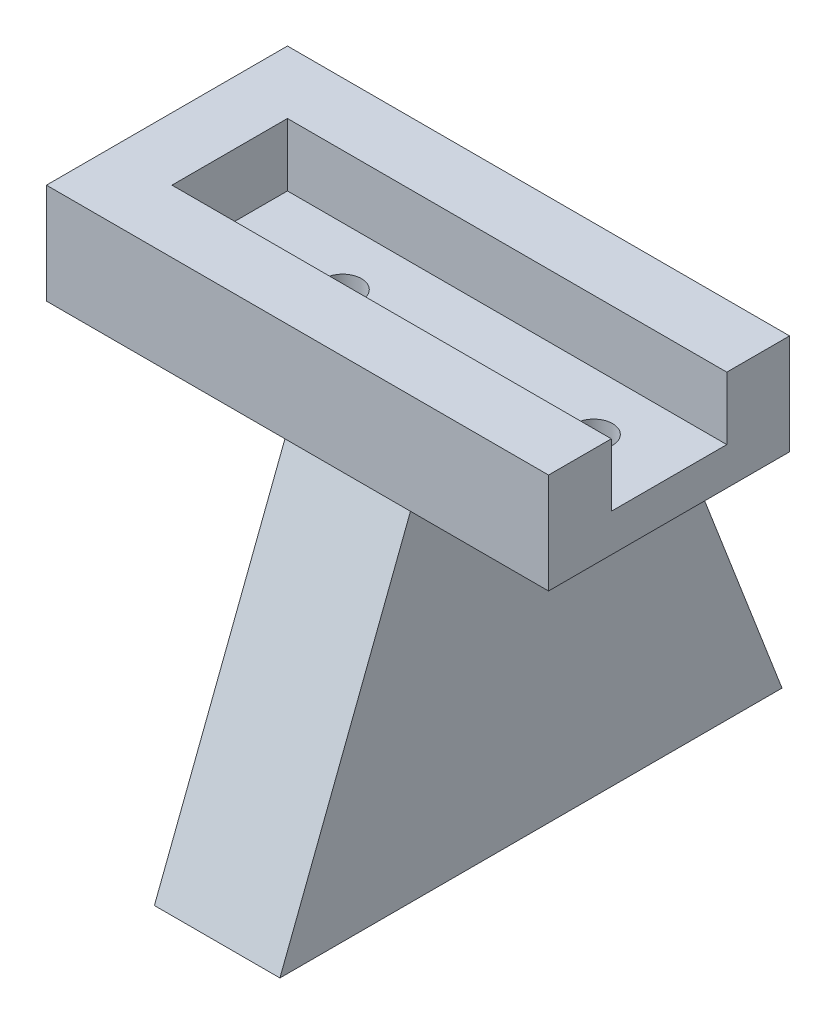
ISO-10303-21;
HEADER;
FILE_DESCRIPTION(('STEP AP214'),'2;1');
FILE_NAME('part.step','',(''),(''),'','','');
FILE_SCHEMA(('AUTOMOTIVE_DESIGN { 1 0 10303 214 1 1 1 1 }'));
ENDSEC;
DATA;
#1=APPLICATION_CONTEXT('core data for automotive mechanical design processes');
#2=APPLICATION_PROTOCOL_DEFINITION('international standard','automotive_design',2000,#1);
#3=PRODUCT_CONTEXT('',#1,'mechanical');
#4=PRODUCT('Part','Part','',(#3));
#5=PRODUCT_RELATED_PRODUCT_CATEGORY('part','',(#4));
#6=PRODUCT_DEFINITION_FORMATION('','',#4);
#7=PRODUCT_DEFINITION_CONTEXT('part definition',#1,'design');
#8=PRODUCT_DEFINITION('design','',#6,#7);
#9=PRODUCT_DEFINITION_SHAPE('','',#8);
#10=(LENGTH_UNIT() NAMED_UNIT(*) SI_UNIT(.MILLI.,.METRE.));
#11=(NAMED_UNIT(*) PLANE_ANGLE_UNIT() SI_UNIT($,.RADIAN.));
#12=(NAMED_UNIT(*) SI_UNIT($,.STERADIAN.) SOLID_ANGLE_UNIT());
#13=UNCERTAINTY_MEASURE_WITH_UNIT(LENGTH_MEASURE(1.E-05),#10,'distance_accuracy_value','');
#14=(GEOMETRIC_REPRESENTATION_CONTEXT(3) GLOBAL_UNCERTAINTY_ASSIGNED_CONTEXT((#13)) GLOBAL_UNIT_ASSIGNED_CONTEXT((#10,
#11,#12)) REPRESENTATION_CONTEXT('',''));
#15=CARTESIAN_POINT('',(0.,0.,0.));
#16=DIRECTION('',(0.,0.,1.));
#17=DIRECTION('',(1.,0.,0.));
#18=AXIS2_PLACEMENT_3D('',#15,#16,#17);
#19=CARTESIAN_POINT('',(-9.,-3.,9.6));
#20=DIRECTION('',(0.,-1.,0.));
#21=DIRECTION('',(0.,0.,-1.));
#22=AXIS2_PLACEMENT_3D('',#19,#20,#21);
#23=PLANE('',#22);
#24=CARTESIAN_POINT('',(0.,-3.,0.));
#25=DIRECTION('',(0.,1.,0.));
#26=DIRECTION('',(0.,0.,1.));
#27=AXIS2_PLACEMENT_3D('',#24,#25,#26);
#28=CIRCLE('',#27,1.5);
#29=CARTESIAN_POINT('',(0.,-3.,1.5));
#30=VERTEX_POINT('',#29);
#31=EDGE_CURVE('E207',#30,#30,#28,.T.);
#32=ORIENTED_EDGE('',*,*,#31,.T.);
#33=EDGE_LOOP('',(#32));
#34=FACE_BOUND('',#33,.T.);
#35=DIRECTION('',(1.,0.,0.));
#36=VECTOR('',#35,1.);
#37=CARTESIAN_POINT('',(-9.,-3.,-9.6));
#38=LINE('',#37,#36);
#39=CARTESIAN_POINT('',(-14.,-3.,-9.6));
#40=VERTEX_POINT('',#39);
#41=CARTESIAN_POINT('',(5.,-3.,-9.6));
#42=VERTEX_POINT('',#41);
#43=EDGE_CURVE('E135',#40,#42,#38,.T.);
#44=ORIENTED_EDGE('',*,*,#43,.T.);
#45=DIRECTION('',(0.,0.,1.));
#46=VECTOR('',#45,1.);
#47=CARTESIAN_POINT('',(5.,-3.,9.6));
#48=LINE('',#47,#46);
#49=CARTESIAN_POINT('',(5.,-3.,9.6));
#50=VERTEX_POINT('',#49);
#51=EDGE_CURVE('E61',#42,#50,#48,.T.);
#52=ORIENTED_EDGE('',*,*,#51,.T.);
#53=DIRECTION('',(1.,0.,0.));
#54=VECTOR('',#53,1.);
#55=CARTESIAN_POINT('',(-9.,-3.,9.6));
#56=LINE('',#55,#54);
#57=CARTESIAN_POINT('',(-14.,-3.,9.6));
#58=VERTEX_POINT('',#57);
#59=EDGE_CURVE('E47',#58,#50,#56,.T.);
#60=ORIENTED_EDGE('',*,*,#59,.F.);
#61=DIRECTION('',(0.,0.,1.));
#62=VECTOR('',#61,1.);
#63=CARTESIAN_POINT('',(-14.,-3.,9.6));
#64=LINE('',#63,#62);
#65=EDGE_CURVE('E147',#40,#58,#64,.T.);
#66=ORIENTED_EDGE('',*,*,#65,.F.);
#67=EDGE_LOOP('',(#44,#52,#60,#66));
#68=FACE_BOUND('',#67,.T.);
#69=ADVANCED_FACE('F43',(#34,#68),#23,.T.);
#70=CARTESIAN_POINT('',(-9.,5.,9.6));
#71=DIRECTION('',(0.,0.,1.));
#72=DIRECTION('',(0.,-1.,0.));
#73=AXIS2_PLACEMENT_3D('',#70,#71,#72);
#74=PLANE('',#73);
#75=ORIENTED_EDGE('',*,*,#59,.T.);
#76=DIRECTION('',(-1.,0.,0.));
#77=VECTOR('',#76,1.);
#78=CARTESIAN_POINT('',(15.,-3.,9.6));
#79=LINE('',#78,#77);
#80=CARTESIAN_POINT('',(15.,-3.,9.6));
#81=VERTEX_POINT('',#80);
#82=EDGE_CURVE('E202',#81,#50,#79,.T.);
#83=ORIENTED_EDGE('',*,*,#82,.F.);
#84=CARTESIAN_POINT('',(26.,-3.,9.6));
#85=VERTEX_POINT('',#84);
#86=EDGE_CURVE('E265',#81,#85,#56,.T.);
#87=ORIENTED_EDGE('',*,*,#86,.T.);
#88=DIRECTION('',(0.,-1.,0.));
#89=VECTOR('',#88,1.);
#90=CARTESIAN_POINT('',(26.,5.,9.6));
#91=LINE('',#90,#89);
#92=CARTESIAN_POINT('',(26.,5.,9.6));
#93=VERTEX_POINT('',#92);
#94=EDGE_CURVE('E222',#93,#85,#91,.T.);
#95=ORIENTED_EDGE('',*,*,#94,.F.);
#96=DIRECTION('',(1.,0.,0.));
#97=VECTOR('',#96,1.);
#98=CARTESIAN_POINT('',(-9.,5.,9.6));
#99=LINE('',#98,#97);
#100=CARTESIAN_POINT('',(-14.,5.,9.6));
#101=VERTEX_POINT('',#100);
#102=EDGE_CURVE('E11',#101,#93,#99,.T.);
#103=ORIENTED_EDGE('',*,*,#102,.F.);
#104=DIRECTION('',(0.,1.,0.));
#105=VECTOR('',#104,1.);
#106=CARTESIAN_POINT('',(-14.,5.,9.6));
#107=LINE('',#106,#105);
#108=EDGE_CURVE('E152',#58,#101,#107,.T.);
#109=ORIENTED_EDGE('',*,*,#108,.F.);
#110=EDGE_LOOP('',(#75,#83,#87,#95,#103,#109));
#111=FACE_BOUND('',#110,.T.);
#112=ADVANCED_FACE('F45',(#111),#74,.T.);
#113=CARTESIAN_POINT('',(-9.,5.,4.6));
#114=DIRECTION('',(0.,1.,0.));
#115=DIRECTION('',(0.,0.,1.));
#116=AXIS2_PLACEMENT_3D('',#113,#114,#115);
#117=PLANE('',#116);
#118=ORIENTED_EDGE('',*,*,#102,.T.);
#119=DIRECTION('',(0.,0.,1.));
#120=VECTOR('',#119,1.);
#121=CARTESIAN_POINT('',(26.,5.,4.6));
#122=LINE('',#121,#120);
#123=CARTESIAN_POINT('',(26.,5.,4.6));
#124=VERTEX_POINT('',#123);
#125=EDGE_CURVE('E250',#124,#93,#122,.T.);
#126=ORIENTED_EDGE('',*,*,#125,.F.);
#127=DIRECTION('',(1.,0.,0.));
#128=VECTOR('',#127,1.);
#129=CARTESIAN_POINT('',(-9.,5.,4.6));
#130=LINE('',#129,#128);
#131=CARTESIAN_POINT('',(-9.,5.,4.6));
#132=VERTEX_POINT('',#131);
#133=EDGE_CURVE('E53',#132,#124,#130,.T.);
#134=ORIENTED_EDGE('',*,*,#133,.F.);
#135=DIRECTION('',(0.,0.,-1.));
#136=VECTOR('',#135,1.);
#137=CARTESIAN_POINT('',(-9.,5.,-9.6));
#138=LINE('',#137,#136);
#139=CARTESIAN_POINT('',(-9.,5.,-4.6));
#140=VERTEX_POINT('',#139);
#141=EDGE_CURVE('E159',#132,#140,#138,.T.);
#142=ORIENTED_EDGE('',*,*,#141,.T.);
#143=DIRECTION('',(1.,0.,0.));
#144=VECTOR('',#143,1.);
#145=CARTESIAN_POINT('',(-9.,5.,-4.6));
#146=LINE('',#145,#144);
#147=CARTESIAN_POINT('',(26.,5.,-4.6));
#148=VERTEX_POINT('',#147);
#149=EDGE_CURVE('E275',#140,#148,#146,.T.);
#150=ORIENTED_EDGE('',*,*,#149,.T.);
#151=DIRECTION('',(0.,0.,1.));
#152=VECTOR('',#151,1.);
#153=CARTESIAN_POINT('',(26.,5.,-4.6));
#154=LINE('',#153,#152);
#155=CARTESIAN_POINT('',(26.,5.,-9.6));
#156=VERTEX_POINT('',#155);
#157=EDGE_CURVE('E234',#156,#148,#154,.T.);
#158=ORIENTED_EDGE('',*,*,#157,.F.);
#159=DIRECTION('',(1.,0.,0.));
#160=VECTOR('',#159,1.);
#161=CARTESIAN_POINT('',(-9.,5.,-9.6));
#162=LINE('',#161,#160);
#163=CARTESIAN_POINT('',(-14.,5.,-9.6));
#164=VERTEX_POINT('',#163);
#165=EDGE_CURVE('E144',#164,#156,#162,.T.);
#166=ORIENTED_EDGE('',*,*,#165,.F.);
#167=DIRECTION('',(0.,0.,-1.));
#168=VECTOR('',#167,1.);
#169=CARTESIAN_POINT('',(-14.,5.,-9.6));
#170=LINE('',#169,#168);
#171=EDGE_CURVE('E157',#101,#164,#170,.T.);
#172=ORIENTED_EDGE('',*,*,#171,.F.);
#173=EDGE_LOOP('',(#118,#126,#134,#142,#150,#158,#166,#172));
#174=FACE_BOUND('',#173,.T.);
#175=ADVANCED_FACE('F286',(#174),#117,.T.);
#176=CARTESIAN_POINT('',(-9.,0.,4.6));
#177=DIRECTION('',(0.,0.,-1.));
#178=DIRECTION('',(-1.,0.,0.));
#179=AXIS2_PLACEMENT_3D('',#176,#177,#178);
#180=PLANE('',#179);
#181=ORIENTED_EDGE('',*,*,#133,.T.);
#182=DIRECTION('',(0.,1.,0.));
#183=VECTOR('',#182,1.);
#184=CARTESIAN_POINT('',(26.,0.,4.6));
#185=LINE('',#184,#183);
#186=CARTESIAN_POINT('',(26.,0.,4.6));
#187=VERTEX_POINT('',#186);
#188=EDGE_CURVE('E246',#187,#124,#185,.T.);
#189=ORIENTED_EDGE('',*,*,#188,.F.);
#190=DIRECTION('',(1.,0.,0.));
#191=VECTOR('',#190,1.);
#192=CARTESIAN_POINT('',(-9.,0.,4.6));
#193=LINE('',#192,#191);
#194=CARTESIAN_POINT('',(-9.,0.,4.6));
#195=VERTEX_POINT('',#194);
#196=EDGE_CURVE('E269',#195,#187,#193,.T.);
#197=ORIENTED_EDGE('',*,*,#196,.F.);
#198=DIRECTION('',(0.,1.,0.));
#199=VECTOR('',#198,1.);
#200=CARTESIAN_POINT('',(-9.,0.,4.6));
#201=LINE('',#200,#199);
#202=EDGE_CURVE('E262',#195,#132,#201,.T.);
#203=ORIENTED_EDGE('',*,*,#202,.T.);
#204=EDGE_LOOP('',(#181,#189,#197,#203));
#205=FACE_BOUND('',#204,.T.);
#206=ADVANCED_FACE('F298',(#205),#180,.T.);
#207=CARTESIAN_POINT('',(-9.,0.,4.6));
#208=DIRECTION('',(0.,1.,0.));
#209=DIRECTION('',(0.,0.,1.));
#210=AXIS2_PLACEMENT_3D('',#207,#208,#209);
#211=PLANE('',#210);
#212=CARTESIAN_POINT('',(0.,0.,0.));
#213=DIRECTION('',(0.,1.,0.));
#214=DIRECTION('',(0.,0.,1.));
#215=AXIS2_PLACEMENT_3D('',#212,#213,#214);
#216=CIRCLE('',#215,1.5);
#217=CARTESIAN_POINT('',(0.,0.,1.5));
#218=VERTEX_POINT('',#217);
#219=EDGE_CURVE('E218',#218,#218,#216,.T.);
#220=ORIENTED_EDGE('',*,*,#219,.F.);
#221=EDGE_LOOP('',(#220));
#222=FACE_BOUND('',#221,.T.);
#223=CARTESIAN_POINT('',(20.,0.,0.));
#224=DIRECTION('',(0.,1.,0.));
#225=DIRECTION('',(0.,0.,1.));
#226=AXIS2_PLACEMENT_3D('',#223,#224,#225);
#227=CIRCLE('',#226,1.5);
#228=CARTESIAN_POINT('',(20.,0.,1.5));
#229=VERTEX_POINT('',#228);
#230=EDGE_CURVE('E211',#229,#229,#227,.T.);
#231=ORIENTED_EDGE('',*,*,#230,.F.);
#232=EDGE_LOOP('',(#231));
#233=FACE_BOUND('',#232,.T.);
#234=ORIENTED_EDGE('',*,*,#196,.T.);
#235=DIRECTION('',(0.,0.,1.));
#236=VECTOR('',#235,1.);
#237=CARTESIAN_POINT('',(26.,0.,4.6));
#238=LINE('',#237,#236);
#239=CARTESIAN_POINT('',(26.,0.,-4.6));
#240=VERTEX_POINT('',#239);
#241=EDGE_CURVE('E242',#240,#187,#238,.T.);
#242=ORIENTED_EDGE('',*,*,#241,.F.);
#243=DIRECTION('',(1.,0.,0.));
#244=VECTOR('',#243,1.);
#245=CARTESIAN_POINT('',(-9.,0.,-4.6));
#246=LINE('',#245,#244);
#247=CARTESIAN_POINT('',(-9.,0.,-4.6));
#248=VERTEX_POINT('',#247);
#249=EDGE_CURVE('E272',#248,#240,#246,.T.);
#250=ORIENTED_EDGE('',*,*,#249,.F.);
#251=DIRECTION('',(0.,0.,1.));
#252=VECTOR('',#251,1.);
#253=CARTESIAN_POINT('',(-9.,0.,4.6));
#254=LINE('',#253,#252);
#255=EDGE_CURVE('E258',#248,#195,#254,.T.);
#256=ORIENTED_EDGE('',*,*,#255,.T.);
#257=EDGE_LOOP('',(#234,#242,#250,#256));
#258=FACE_BOUND('',#257,.T.);
#259=ADVANCED_FACE('F295',(#222,#233,#258),#211,.T.);
#260=CARTESIAN_POINT('',(-9.,0.,-4.6));
#261=DIRECTION('',(0.,0.,1.));
#262=DIRECTION('',(1.,0.,0.));
#263=AXIS2_PLACEMENT_3D('',#260,#261,#262);
#264=PLANE('',#263);
#265=ORIENTED_EDGE('',*,*,#249,.T.);
#266=DIRECTION('',(0.,-1.,0.));
#267=VECTOR('',#266,1.);
#268=CARTESIAN_POINT('',(26.,0.,-4.6));
#269=LINE('',#268,#267);
#270=EDGE_CURVE('E238',#148,#240,#269,.T.);
#271=ORIENTED_EDGE('',*,*,#270,.F.);
#272=ORIENTED_EDGE('',*,*,#149,.F.);
#273=DIRECTION('',(0.,-1.,0.));
#274=VECTOR('',#273,1.);
#275=CARTESIAN_POINT('',(-9.,0.,-4.6));
#276=LINE('',#275,#274);
#277=EDGE_CURVE('E254',#140,#248,#276,.T.);
#278=ORIENTED_EDGE('',*,*,#277,.T.);
#279=EDGE_LOOP('',(#265,#271,#272,#278));
#280=FACE_BOUND('',#279,.T.);
#281=ADVANCED_FACE('F290',(#280),#264,.T.);
#282=CARTESIAN_POINT('',(-9.,-3.,-9.6));
#283=DIRECTION('',(0.,0.,-1.));
#284=DIRECTION('',(-1.,0.,0.));
#285=AXIS2_PLACEMENT_3D('',#282,#283,#284);
#286=PLANE('',#285);
#287=ORIENTED_EDGE('',*,*,#165,.T.);
#288=DIRECTION('',(0.,1.,0.));
#289=VECTOR('',#288,1.);
#290=CARTESIAN_POINT('',(26.,-3.,-9.6));
#291=LINE('',#290,#289);
#292=CARTESIAN_POINT('',(26.,-3.,-9.6));
#293=VERTEX_POINT('',#292);
#294=EDGE_CURVE('E230',#293,#156,#291,.T.);
#295=ORIENTED_EDGE('',*,*,#294,.F.);
#296=CARTESIAN_POINT('',(15.,-3.,-9.6));
#297=VERTEX_POINT('',#296);
#298=EDGE_CURVE('E145',#297,#293,#38,.T.);
#299=ORIENTED_EDGE('',*,*,#298,.F.);
#300=DIRECTION('',(-1.,0.,0.));
#301=VECTOR('',#300,1.);
#302=CARTESIAN_POINT('',(15.,-3.,-9.6));
#303=LINE('',#302,#301);
#304=EDGE_CURVE('E141',#297,#42,#303,.T.);
#305=ORIENTED_EDGE('',*,*,#304,.T.);
#306=ORIENTED_EDGE('',*,*,#43,.F.);
#307=DIRECTION('',(0.,-1.,0.));
#308=VECTOR('',#307,1.);
#309=CARTESIAN_POINT('',(-14.,-3.,-9.6));
#310=LINE('',#309,#308);
#311=EDGE_CURVE('E139',#164,#40,#310,.T.);
#312=ORIENTED_EDGE('',*,*,#311,.F.);
#313=EDGE_LOOP('',(#287,#295,#299,#305,#306,#312));
#314=FACE_BOUND('',#313,.T.);
#315=ADVANCED_FACE('F137',(#314),#286,.T.);
#316=DIRECTION('',(0.,0.,1.));
#317=VECTOR('',#316,1.);
#318=CARTESIAN_POINT('',(15.,-3.,9.6));
#319=LINE('',#318,#317);
#320=EDGE_CURVE('E69',#297,#81,#319,.T.);
#321=ORIENTED_EDGE('',*,*,#320,.F.);
#322=ORIENTED_EDGE('',*,*,#298,.T.);
#323=DIRECTION('',(0.,0.,-1.));
#324=VECTOR('',#323,1.);
#325=CARTESIAN_POINT('',(26.,-3.,9.6));
#326=LINE('',#325,#324);
#327=EDGE_CURVE('E226',#85,#293,#326,.T.);
#328=ORIENTED_EDGE('',*,*,#327,.F.);
#329=ORIENTED_EDGE('',*,*,#86,.F.);
#330=EDGE_LOOP('',(#321,#322,#328,#329));
#331=FACE_BOUND('',#330,.T.);
#332=CARTESIAN_POINT('',(20.,-3.,0.));
#333=DIRECTION('',(0.,1.,0.));
#334=DIRECTION('',(0.,0.,1.));
#335=AXIS2_PLACEMENT_3D('',#332,#333,#334);
#336=CIRCLE('',#335,1.5);
#337=CARTESIAN_POINT('',(20.,-3.,1.5));
#338=VERTEX_POINT('',#337);
#339=EDGE_CURVE('E206',#338,#338,#336,.T.);
#340=ORIENTED_EDGE('',*,*,#339,.T.);
#341=EDGE_LOOP('',(#340));
#342=FACE_BOUND('',#341,.T.);
#343=ADVANCED_FACE('F304',(#331,#342),#23,.T.);
#344=CARTESIAN_POINT('',(26.,0.,0.));
#345=DIRECTION('',(1.,0.,0.));
#346=DIRECTION('',(0.,0.,-1.));
#347=AXIS2_PLACEMENT_3D('',#344,#345,#346);
#348=PLANE('',#347);
#349=ORIENTED_EDGE('',*,*,#94,.T.);
#350=ORIENTED_EDGE('',*,*,#327,.T.);
#351=ORIENTED_EDGE('',*,*,#294,.T.);
#352=ORIENTED_EDGE('',*,*,#157,.T.);
#353=ORIENTED_EDGE('',*,*,#270,.T.);
#354=ORIENTED_EDGE('',*,*,#241,.T.);
#355=ORIENTED_EDGE('',*,*,#188,.T.);
#356=ORIENTED_EDGE('',*,*,#125,.T.);
#357=EDGE_LOOP('',(#349,#350,#351,#352,#353,#354,#355,#356));
#358=FACE_BOUND('',#357,.T.);
#359=ADVANCED_FACE('F283',(#358),#348,.T.);
#360=CARTESIAN_POINT('',(20.,-3.,0.));
#361=DIRECTION('',(0.,1.,0.));
#362=DIRECTION('',(0.,0.,1.));
#363=AXIS2_PLACEMENT_3D('',#360,#361,#362);
#364=CYLINDRICAL_SURFACE('',#363,1.5);
#365=ORIENTED_EDGE('',*,*,#230,.T.);
#366=EDGE_LOOP('',(#365));
#367=FACE_BOUND('',#366,.T.);
#368=ORIENTED_EDGE('',*,*,#339,.F.);
#369=EDGE_LOOP('',(#368));
#370=FACE_BOUND('',#369,.T.);
#371=ADVANCED_FACE('F345',(#367,#370),#364,.F.);
#372=CARTESIAN_POINT('',(0.,-3.,0.));
#373=DIRECTION('',(0.,1.,0.));
#374=DIRECTION('',(0.,0.,1.));
#375=AXIS2_PLACEMENT_3D('',#372,#373,#374);
#376=CYLINDRICAL_SURFACE('',#375,1.5);
#377=ORIENTED_EDGE('',*,*,#219,.T.);
#378=EDGE_LOOP('',(#377));
#379=FACE_BOUND('',#378,.T.);
#380=ORIENTED_EDGE('',*,*,#31,.F.);
#381=EDGE_LOOP('',(#380));
#382=FACE_BOUND('',#381,.T.);
#383=ADVANCED_FACE('F332',(#379,#382),#376,.F.);
#384=CARTESIAN_POINT('',(15.,-30.,20.));
#385=DIRECTION('',(0.,-0.359442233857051,-0.933167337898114));
#386=DIRECTION('',(0.,0.933167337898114,-0.359442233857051));
#387=AXIS2_PLACEMENT_3D('',#384,#385,#386);
#388=PLANE('',#387);
#389=DIRECTION('',(0.,-0.933167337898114,0.359442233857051));
#390=VECTOR('',#389,1.);
#391=CARTESIAN_POINT('',(5.,-30.,20.));
#392=LINE('',#391,#390);
#393=CARTESIAN_POINT('',(5.,-30.,20.));
#394=VERTEX_POINT('',#393);
#395=EDGE_CURVE('E184',#50,#394,#392,.T.);
#396=ORIENTED_EDGE('',*,*,#395,.T.);
#397=DIRECTION('',(-1.,0.,0.));
#398=VECTOR('',#397,1.);
#399=CARTESIAN_POINT('',(15.,-30.,20.));
#400=LINE('',#399,#398);
#401=CARTESIAN_POINT('',(15.,-30.,20.));
#402=VERTEX_POINT('',#401);
#403=EDGE_CURVE('E198',#402,#394,#400,.T.);
#404=ORIENTED_EDGE('',*,*,#403,.F.);
#405=DIRECTION('',(0.,-0.933167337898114,0.359442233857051));
#406=VECTOR('',#405,1.);
#407=CARTESIAN_POINT('',(15.,-30.,20.));
#408=LINE('',#407,#406);
#409=EDGE_CURVE('E171',#81,#402,#408,.T.);
#410=ORIENTED_EDGE('',*,*,#409,.F.);
#411=ORIENTED_EDGE('',*,*,#82,.T.);
#412=EDGE_LOOP('',(#396,#404,#410,#411));
#413=FACE_BOUND('',#412,.T.);
#414=ADVANCED_FACE('F315',(#413),#388,.F.);
#415=CARTESIAN_POINT('',(15.,-30.,20.));
#416=DIRECTION('',(0.,1.,0.));
#417=DIRECTION('',(0.,0.,1.));
#418=AXIS2_PLACEMENT_3D('',#415,#416,#417);
#419=PLANE('',#418);
#420=DIRECTION('',(0.,0.,-1.));
#421=VECTOR('',#420,1.);
#422=CARTESIAN_POINT('',(5.,-30.,20.));
#423=LINE('',#422,#421);
#424=CARTESIAN_POINT('',(5.,-30.,-20.));
#425=VERTEX_POINT('',#424);
#426=EDGE_CURVE('E187',#394,#425,#423,.T.);
#427=ORIENTED_EDGE('',*,*,#426,.T.);
#428=DIRECTION('',(-1.,0.,0.));
#429=VECTOR('',#428,1.);
#430=CARTESIAN_POINT('',(15.,-30.,-20.));
#431=LINE('',#430,#429);
#432=CARTESIAN_POINT('',(15.,-30.,-20.));
#433=VERTEX_POINT('',#432);
#434=EDGE_CURVE('E194',#433,#425,#431,.T.);
#435=ORIENTED_EDGE('',*,*,#434,.F.);
#436=DIRECTION('',(0.,0.,-1.));
#437=VECTOR('',#436,1.);
#438=CARTESIAN_POINT('',(15.,-30.,20.));
#439=LINE('',#438,#437);
#440=EDGE_CURVE('E175',#402,#433,#439,.T.);
#441=ORIENTED_EDGE('',*,*,#440,.F.);
#442=ORIENTED_EDGE('',*,*,#403,.T.);
#443=EDGE_LOOP('',(#427,#435,#441,#442));
#444=FACE_BOUND('',#443,.T.);
#445=ADVANCED_FACE('F324',(#444),#419,.F.);
#446=CARTESIAN_POINT('',(15.,-30.,-20.));
#447=DIRECTION('',(0.,-0.359442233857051,0.933167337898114));
#448=DIRECTION('',(0.,-0.933167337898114,-0.359442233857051));
#449=AXIS2_PLACEMENT_3D('',#446,#447,#448);
#450=PLANE('',#449);
#451=DIRECTION('',(0.,0.933167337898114,0.359442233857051));
#452=VECTOR('',#451,1.);
#453=CARTESIAN_POINT('',(5.,-30.,-20.));
#454=LINE('',#453,#452);
#455=EDGE_CURVE('E172',#425,#42,#454,.T.);
#456=ORIENTED_EDGE('',*,*,#455,.T.);
#457=ORIENTED_EDGE('',*,*,#304,.F.);
#458=DIRECTION('',(0.,0.933167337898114,0.359442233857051));
#459=VECTOR('',#458,1.);
#460=CARTESIAN_POINT('',(15.,-30.,-20.));
#461=LINE('',#460,#459);
#462=EDGE_CURVE('E178',#433,#297,#461,.T.);
#463=ORIENTED_EDGE('',*,*,#462,.F.);
#464=ORIENTED_EDGE('',*,*,#434,.T.);
#465=EDGE_LOOP('',(#456,#457,#463,#464));
#466=FACE_BOUND('',#465,.T.);
#467=ADVANCED_FACE('F322',(#466),#450,.F.);
#468=CARTESIAN_POINT('',(15.,0.,0.));
#469=DIRECTION('',(1.,0.,0.));
#470=DIRECTION('',(0.,0.,-1.));
#471=AXIS2_PLACEMENT_3D('',#468,#469,#470);
#472=PLANE('',#471);
#473=ORIENTED_EDGE('',*,*,#320,.T.);
#474=ORIENTED_EDGE('',*,*,#409,.T.);
#475=ORIENTED_EDGE('',*,*,#440,.T.);
#476=ORIENTED_EDGE('',*,*,#462,.T.);
#477=EDGE_LOOP('',(#473,#474,#475,#476));
#478=FACE_BOUND('',#477,.T.);
#479=ADVANCED_FACE('F318',(#478),#472,.T.);
#480=CARTESIAN_POINT('',(5.,0.,0.));
#481=DIRECTION('',(1.,0.,0.));
#482=DIRECTION('',(0.,0.,-1.));
#483=AXIS2_PLACEMENT_3D('',#480,#481,#482);
#484=PLANE('',#483);
#485=ORIENTED_EDGE('',*,*,#51,.F.);
#486=ORIENTED_EDGE('',*,*,#455,.F.);
#487=ORIENTED_EDGE('',*,*,#426,.F.);
#488=ORIENTED_EDGE('',*,*,#395,.F.);
#489=EDGE_LOOP('',(#485,#486,#487,#488));
#490=FACE_BOUND('',#489,.T.);
#491=ADVANCED_FACE('F311',(#490),#484,.F.);
#492=CARTESIAN_POINT('',(-9.,0.,0.));
#493=DIRECTION('',(1.,0.,0.));
#494=DIRECTION('',(0.,0.,-1.));
#495=AXIS2_PLACEMENT_3D('',#492,#493,#494);
#496=PLANE('',#495);
#497=ORIENTED_EDGE('',*,*,#202,.F.);
#498=ORIENTED_EDGE('',*,*,#255,.F.);
#499=ORIENTED_EDGE('',*,*,#277,.F.);
#500=ORIENTED_EDGE('',*,*,#141,.F.);
#501=EDGE_LOOP('',(#497,#498,#499,#500));
#502=FACE_BOUND('',#501,.T.);
#503=ADVANCED_FACE('F412',(#502),#496,.T.);
#504=CARTESIAN_POINT('',(-14.,0.,0.));
#505=DIRECTION('',(1.,0.,0.));
#506=DIRECTION('',(0.,0.,-1.));
#507=AXIS2_PLACEMENT_3D('',#504,#505,#506);
#508=PLANE('',#507);
#509=ORIENTED_EDGE('',*,*,#311,.T.);
#510=ORIENTED_EDGE('',*,*,#65,.T.);
#511=ORIENTED_EDGE('',*,*,#108,.T.);
#512=ORIENTED_EDGE('',*,*,#171,.T.);
#513=EDGE_LOOP('',(#509,#510,#511,#512));
#514=FACE_BOUND('',#513,.T.);
#515=ADVANCED_FACE('F155',(#514),#508,.F.);
#516=CLOSED_SHELL('',(#69,#112,#175,#206,#259,#281,#315,#343,#359,#371,#383,#414,#445,#467,#479,
#491,#503,#515));
#517=MANIFOLD_SOLID_BREP('B2',#516);
#518=ADVANCED_BREP_SHAPE_REPRESENTATION('',(#18,#517),#14);
#519=SHAPE_DEFINITION_REPRESENTATION(#9,#518);
ENDSEC;
END-ISO-10303-21;
